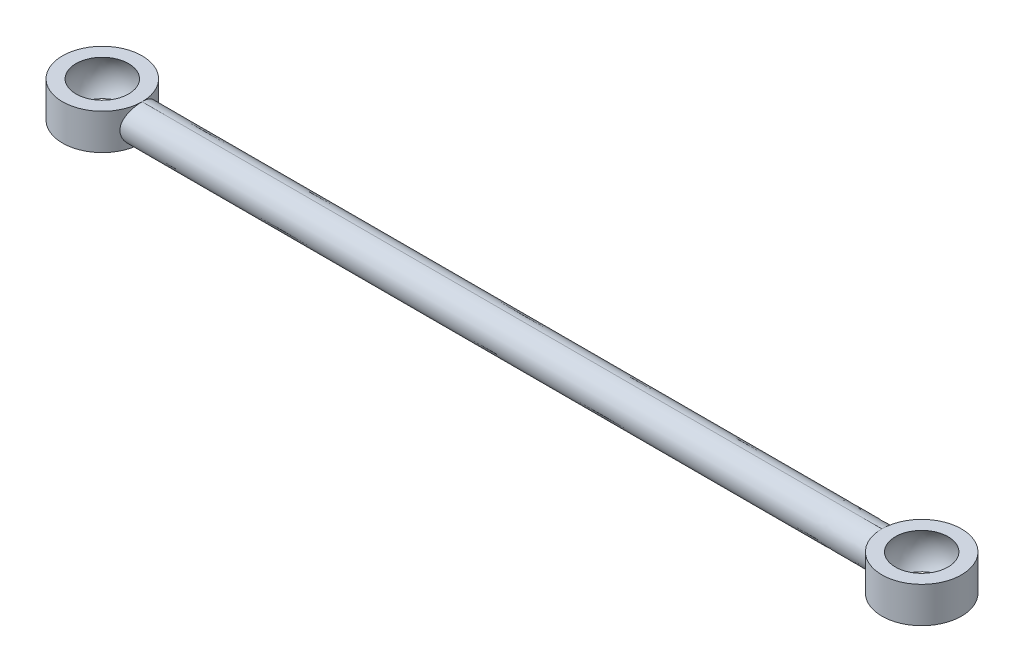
ISO-10303-21;
HEADER;
FILE_DESCRIPTION(('STEP AP214'),'2;1');
FILE_NAME('part.step','',(''),(''),'','','');
FILE_SCHEMA(('AUTOMOTIVE_DESIGN { 1 0 10303 214 1 1 1 1 }'));
ENDSEC;
DATA;
#1=APPLICATION_CONTEXT('core data for automotive mechanical design processes');
#2=APPLICATION_PROTOCOL_DEFINITION('international standard','automotive_design',2000,#1);
#3=PRODUCT_CONTEXT('',#1,'mechanical');
#4=PRODUCT('Part','Part','',(#3));
#5=PRODUCT_RELATED_PRODUCT_CATEGORY('part','',(#4));
#6=PRODUCT_DEFINITION_FORMATION('','',#4);
#7=PRODUCT_DEFINITION_CONTEXT('part definition',#1,'design');
#8=PRODUCT_DEFINITION('design','',#6,#7);
#9=PRODUCT_DEFINITION_SHAPE('','',#8);
#10=(LENGTH_UNIT() NAMED_UNIT(*) SI_UNIT(.MILLI.,.METRE.));
#11=(NAMED_UNIT(*) PLANE_ANGLE_UNIT() SI_UNIT($,.RADIAN.));
#12=(NAMED_UNIT(*) SI_UNIT($,.STERADIAN.) SOLID_ANGLE_UNIT());
#13=UNCERTAINTY_MEASURE_WITH_UNIT(LENGTH_MEASURE(1.E-05),#10,'distance_accuracy_value','');
#14=(GEOMETRIC_REPRESENTATION_CONTEXT(3) GLOBAL_UNCERTAINTY_ASSIGNED_CONTEXT((#13)) GLOBAL_UNIT_ASSIGNED_CONTEXT((#10,
#11,#12)) REPRESENTATION_CONTEXT('',''));
#15=CARTESIAN_POINT('',(0.,0.,0.));
#16=DIRECTION('',(0.,0.,1.));
#17=DIRECTION('',(1.,0.,0.));
#18=AXIS2_PLACEMENT_3D('',#15,#16,#17);
#19=CARTESIAN_POINT('',(-514.5,-22.5,0.));
#20=DIRECTION('',(0.,-1.,0.));
#21=DIRECTION('',(0.,0.,-1.));
#22=AXIS2_PLACEMENT_3D('',#19,#20,#21);
#23=CYLINDRICAL_SURFACE('',#22,50.);
#24=CARTESIAN_POINT('',(-464.500000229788,-22.4999995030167,-0.00464645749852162));
#25=CARTESIAN_POINT('',(-464.500294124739,-22.4993638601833,-2.97611393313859));
#26=CARTESIAN_POINT('',(-464.782487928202,-21.8890026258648,-5.97416280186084));
#27=CARTESIAN_POINT('',(-465.496373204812,-20.1957314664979,-10.0263118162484));
#28=CARTESIAN_POINT('',(-465.784300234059,-19.4945625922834,-11.3296306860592));
#29=CARTESIAN_POINT('',(-466.415109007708,-17.8598798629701,-13.7631098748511));
#30=CARTESIAN_POINT('',(-466.753547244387,-16.9382928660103,-14.8810600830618));
#31=CARTESIAN_POINT('',(-467.441675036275,-14.8885178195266,-16.9317379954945));
#32=CARTESIAN_POINT('',(-467.794316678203,-13.7486965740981,-17.8702274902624));
#33=CARTESIAN_POINT('',(-468.448297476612,-11.3298326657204,-19.493757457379));
#34=CARTESIAN_POINT('',(-468.752142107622,-10.0456498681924,-20.1873168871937));
#35=CARTESIAN_POINT('',(-469.273518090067,-7.31322401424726,-21.3297819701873));
#36=CARTESIAN_POINT('',(-469.484707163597,-5.89208013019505,-21.7653293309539));
#37=CARTESIAN_POINT('',(-469.772169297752,-2.9864457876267,-22.3501076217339));
#38=CARTESIAN_POINT('',(-469.84913182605,-1.47413997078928,-22.5011104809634));
#39=CARTESIAN_POINT('',(-469.848006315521,1.50784613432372,-22.4988768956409));
#40=CARTESIAN_POINT('',(-469.772626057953,2.9814182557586,-22.3510326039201));
#41=CARTESIAN_POINT('',(-469.484500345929,5.89458091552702,-21.7649127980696));
#42=CARTESIAN_POINT('',(-469.270128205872,7.33108852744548,-21.3223629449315));
#43=CARTESIAN_POINT('',(-468.497856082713,11.3781136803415,-19.6300945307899));
#44=CARTESIAN_POINT('',(-467.790410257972,13.8477677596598,-17.9685601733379));
#45=CARTESIAN_POINT('',(-466.759756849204,16.9207576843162,-14.9007689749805));
#46=CARTESIAN_POINT('',(-466.416538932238,17.8560249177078,-13.7680086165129));
#47=CARTESIAN_POINT('',(-465.785959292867,19.4904119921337,-11.3366453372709));
#48=CARTESIAN_POINT('',(-465.501207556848,20.1841051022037,-10.0510171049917));
#49=CARTESIAN_POINT('',(-465.021385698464,21.3225165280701,-7.3328938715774));
#50=CARTESIAN_POINT('',(-464.827053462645,21.7651172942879,-5.89274519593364));
#51=CARTESIAN_POINT('',(-464.568207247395,22.3495524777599,-2.98959195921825));
#52=CARTESIAN_POINT('',(-464.500143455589,22.4996835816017,-1.51162503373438));
#53=CARTESIAN_POINT('',(-464.50000022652,22.4999995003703,-0.00476628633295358));
#54=B_SPLINE_CURVE_WITH_KNOTS('',3,(#24,#25,#26,#27,#28,#29,#30,#31,#32,#33,#34,#35,#36,#37,#38,
#39,#40,#41,#42,#43,#44,#45,#46,#47,#48,#49,#50,#51,#52,#53),.UNSPECIFIED.,.F.,.F.,(4,2,2,2,2,2,
2,2,2,2,2,2,2,2,4),(6.58263718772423E-05,0.125000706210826,0.187500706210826,0.250000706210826,
0.312500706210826,0.375000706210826,0.437500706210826,0.500000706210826,0.562500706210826,
0.625000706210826,0.750000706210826,0.812500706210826,0.875000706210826,0.937500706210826,
0.999934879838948),.UNSPECIFIED.);
#55=CARTESIAN_POINT('',(-464.500000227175,22.5,-0.00476628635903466));
#56=VERTEX_POINT('',#55);
#57=CARTESIAN_POINT('',(-464.500000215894,-22.5,-0.00464643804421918));
#58=VERTEX_POINT('',#57);
#59=EDGE_CURVE('E172',#56,#58,#54,.F.);
#60=ORIENTED_EDGE('',*,*,#59,.T.);
#61=CARTESIAN_POINT('',(-514.5,-22.5,0.));
#62=DIRECTION('',(0.,-1.,0.));
#63=DIRECTION('',(0.,0.,-1.));
#64=AXIS2_PLACEMENT_3D('',#61,#62,#63);
#65=CIRCLE('',#64,50.);
#66=CARTESIAN_POINT('',(-464.500000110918,-22.5,0.00333043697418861));
#67=VERTEX_POINT('',#66);
#68=EDGE_CURVE('E60',#67,#58,#65,.T.);
#69=ORIENTED_EDGE('',*,*,#68,.F.);
#70=CARTESIAN_POINT('',(-464.500000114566,22.4999997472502,0.00334427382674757));
#71=CARTESIAN_POINT('',(-464.500103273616,22.4997721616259,1.50901898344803));
#72=CARTESIAN_POINT('',(-464.56986999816,22.3458529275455,3.01657105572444));
#73=CARTESIAN_POINT('',(-464.829918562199,21.7585926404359,5.91639498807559));
#74=CARTESIAN_POINT('',(-465.019807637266,21.3262180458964,7.32322757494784));
#75=CARTESIAN_POINT('',(-465.501203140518,20.1841579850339,10.0517165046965));
#76=CARTESIAN_POINT('',(-465.790111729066,19.4797858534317,11.3532190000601));
#77=CARTESIAN_POINT('',(-466.415244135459,17.8592437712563,13.7624507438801));
#78=CARTESIAN_POINT('',(-466.755035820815,16.9346802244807,14.8865248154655));
#79=CARTESIAN_POINT('',(-467.449799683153,14.8634834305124,16.9549071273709));
#80=CARTESIAN_POINT('',(-467.796026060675,13.7427378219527,17.8746088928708));
#81=CARTESIAN_POINT('',(-468.448794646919,11.3276288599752,19.4948534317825));
#82=CARTESIAN_POINT('',(-468.757668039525,10.0191964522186,20.1996545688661));
#83=CARTESIAN_POINT('',(-469.532732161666,5.94967514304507,21.8973225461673));
#84=CARTESIAN_POINT('',(-469.849389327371,2.95655201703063,22.5016214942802));
#85=CARTESIAN_POINT('',(-469.848161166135,-1.49674742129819,22.4991841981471));
#86=CARTESIAN_POINT('',(-469.771084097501,-3.00449765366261,22.3479729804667));
#87=CARTESIAN_POINT('',(-469.48143565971,-5.91795772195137,21.7586001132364));
#88=CARTESIAN_POINT('',(-469.272022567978,-7.31979343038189,21.3263888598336));
#89=CARTESIAN_POINT('',(-468.756852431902,-10.0222244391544,20.197753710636));
#90=CARTESIAN_POINT('',(-468.44776635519,-11.3316917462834,19.49239898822));
#91=CARTESIAN_POINT('',(-467.795486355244,-13.744475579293,17.8731711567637));
#92=CARTESIAN_POINT('',(-467.450264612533,-14.8617196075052,16.9558200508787));
#93=CARTESIAN_POINT('',(-466.413308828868,-17.9541723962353,13.8701069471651));
#94=CARTESIAN_POINT('',(-465.741408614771,-19.6143524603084,11.4141396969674));
#95=CARTESIAN_POINT('',(-465.019262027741,-21.3274840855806,7.31964988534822));
#96=CARTESIAN_POINT('',(-464.828887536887,-21.7609508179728,5.90942515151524));
#97=CARTESIAN_POINT('',(-464.568425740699,-22.3490843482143,2.99589903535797));
#98=CARTESIAN_POINT('',(-464.500102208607,-22.4997745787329,1.48705550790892));
#99=CARTESIAN_POINT('',(-464.500000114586,-22.4999997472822,0.00333045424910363));
#100=B_SPLINE_CURVE_WITH_KNOTS('',3,(#70,#71,#72,#73,#74,#75,#76,#77,#78,#79,#80,#81,#82,#83,
#84,#85,#86,#87,#88,#89,#90,#91,#92,#93,#94,#95,#96,#97,#98,#99),.UNSPECIFIED.,.F.,.F.,(4,2,2,2,
2,2,2,2,2,2,2,2,2,2,4),(4.67293220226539E-05,0.0625004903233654,0.125000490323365,
0.187500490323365,0.250000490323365,0.312500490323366,0.375000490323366,0.500000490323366,
0.562500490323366,0.625000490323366,0.687500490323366,0.750000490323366,0.875000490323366,
0.937500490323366,0.999953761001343),.UNSPECIFIED.);
#101=CARTESIAN_POINT('',(-464.500000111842,22.5,0.00334427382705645));
#102=VERTEX_POINT('',#101);
#103=EDGE_CURVE('E96',#67,#102,#100,.F.);
#104=ORIENTED_EDGE('',*,*,#103,.T.);
#105=CARTESIAN_POINT('',(-514.5,22.5,0.));
#106=DIRECTION('',(0.,-1.,0.));
#107=DIRECTION('',(0.,0.,-1.));
#108=AXIS2_PLACEMENT_3D('',#105,#106,#107);
#109=CIRCLE('',#108,50.);
#110=EDGE_CURVE('E113',#102,#56,#109,.T.);
#111=ORIENTED_EDGE('',*,*,#110,.T.);
#112=EDGE_LOOP('',(#60,#69,#104,#111));
#113=FACE_BOUND('',#112,.T.);
#114=ADVANCED_FACE('F37',(#113),#23,.T.);
#115=CARTESIAN_POINT('',(-514.5,-1.19892921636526E-13,0.));
#116=DIRECTION('',(0.,-1.,0.));
#117=DIRECTION('',(-1.,0.,0.));
#118=AXIS2_PLACEMENT_3D('',#115,#116,#117);
#119=SPHERICAL_SURFACE('',#118,40.0000000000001);
#120=CARTESIAN_POINT('',(-514.5,22.5,0.));
#121=DIRECTION('',(0.,-1.,0.));
#122=DIRECTION('',(0.,0.,-1.));
#123=AXIS2_PLACEMENT_3D('',#120,#121,#122);
#124=CIRCLE('',#123,33.0718913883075);
#125=CARTESIAN_POINT('',(-547.571891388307,22.5,0.));
#126=VERTEX_POINT('',#125);
#127=EDGE_CURVE('E111',#126,#126,#124,.T.);
#128=CARTESIAN_POINT('',(-514.5,-22.5,0.));
#129=DIRECTION('',(0.,-1.,0.));
#130=DIRECTION('',(0.,0.,-1.));
#131=AXIS2_PLACEMENT_3D('',#128,#129,#130);
#132=CIRCLE('',#131,33.0718913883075);
#133=CARTESIAN_POINT('',(-547.571891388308,-22.5,0.));
#134=VERTEX_POINT('',#133);
#135=EDGE_CURVE('E11',#134,#134,#132,.T.);
#136=CARTESIAN_POINT('',(-547.571891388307,22.5,0.));
#137=CARTESIAN_POINT('',(-547.851929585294,22.0883908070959,0.));
#138=CARTESIAN_POINT('',(-548.124275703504,21.671548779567,0.));
#139=CARTESIAN_POINT('',(-548.65322145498,20.827990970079,0.));
#140=CARTESIAN_POINT('',(-548.909821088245,20.4012751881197,0.));
#141=CARTESIAN_POINT('',(-549.406911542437,19.5385617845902,0.));
#142=CARTESIAN_POINT('',(-549.647402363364,19.1025641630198,0.));
#143=CARTESIAN_POINT('',(-550.11194120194,18.2218956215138,0.));
#144=CARTESIAN_POINT('',(-550.33598921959,17.7772247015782,0.));
#145=CARTESIAN_POINT('',(-550.767329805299,16.8798292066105,0.));
#146=CARTESIAN_POINT('',(-550.974622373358,16.4271046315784,0.));
#147=CARTESIAN_POINT('',(-551.372163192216,15.5142329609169,0.));
#148=CARTESIAN_POINT('',(-551.562411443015,15.0540858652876,0.));
#149=CARTESIAN_POINT('',(-551.925598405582,14.1270105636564,0.));
#150=CARTESIAN_POINT('',(-552.098537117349,13.6600823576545,0.));
#151=CARTESIAN_POINT('',(-552.426863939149,12.7200957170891,0.));
#152=CARTESIAN_POINT('',(-552.582252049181,12.2470372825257,0.));
#153=CARTESIAN_POINT('',(-552.875261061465,11.2954496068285,0.));
#154=CARTESIAN_POINT('',(-553.012881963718,10.8169203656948,0.));
#155=CARTESIAN_POINT('',(-553.270164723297,9.855058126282,0.));
#156=CARTESIAN_POINT('',(-553.389826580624,9.37172512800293,0.));
#157=CARTESIAN_POINT('',(-553.611024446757,8.40092911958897,0.));
#158=CARTESIAN_POINT('',(-553.712560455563,7.91346610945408,0.));
#159=CARTESIAN_POINT('',(-553.897365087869,6.93508957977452,0.));
#160=CARTESIAN_POINT('',(-553.980633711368,6.44417606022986,0.));
#161=CARTESIAN_POINT('',(-554.128787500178,5.45958282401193,0.));
#162=CARTESIAN_POINT('',(-554.193672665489,4.96590310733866,0.));
#163=CARTESIAN_POINT('',(-554.304969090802,3.97646564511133,0.));
#164=CARTESIAN_POINT('',(-554.351380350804,3.48070789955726,0.));
#165=CARTESIAN_POINT('',(-554.425664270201,2.48780544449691,0.));
#166=CARTESIAN_POINT('',(-554.453536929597,1.99066073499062,0.));
#167=CARTESIAN_POINT('',(-554.490704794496,0.995677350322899,0.));
#168=CARTESIAN_POINT('',(-554.5,0.497838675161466,0.));
#169=CARTESIAN_POINT('',(-554.5,-0.497838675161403,0.));
#170=CARTESIAN_POINT('',(-554.490704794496,-0.995677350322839,0.));
#171=CARTESIAN_POINT('',(-554.453536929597,-1.99066073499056,0.));
#172=CARTESIAN_POINT('',(-554.425664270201,-2.48780544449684,0.));
#173=CARTESIAN_POINT('',(-554.351380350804,-3.4807078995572,0.));
#174=CARTESIAN_POINT('',(-554.304969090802,-3.97646564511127,0.));
#175=CARTESIAN_POINT('',(-554.19367266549,-4.9659031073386,0.));
#176=CARTESIAN_POINT('',(-554.128787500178,-5.45958282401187,0.));
#177=CARTESIAN_POINT('',(-553.980633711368,-6.44417606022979,0.));
#178=CARTESIAN_POINT('',(-553.897365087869,-6.93508957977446,0.));
#179=CARTESIAN_POINT('',(-553.712560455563,-7.91346610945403,0.));
#180=CARTESIAN_POINT('',(-553.611024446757,-8.40092911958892,0.));
#181=CARTESIAN_POINT('',(-553.389826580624,-9.37172512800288,0.));
#182=CARTESIAN_POINT('',(-553.270164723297,-9.85505812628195,0.));
#183=CARTESIAN_POINT('',(-553.012881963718,-10.8169203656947,0.));
#184=CARTESIAN_POINT('',(-552.875261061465,-11.2954496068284,0.));
#185=CARTESIAN_POINT('',(-552.582252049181,-12.2470372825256,0.));
#186=CARTESIAN_POINT('',(-552.426863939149,-12.7200957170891,0.));
#187=CARTESIAN_POINT('',(-552.098537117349,-13.6600823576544,0.));
#188=CARTESIAN_POINT('',(-551.925598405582,-14.1270105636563,0.));
#189=CARTESIAN_POINT('',(-551.562411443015,-15.0540858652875,0.));
#190=CARTESIAN_POINT('',(-551.372163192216,-15.5142329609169,0.));
#191=CARTESIAN_POINT('',(-550.974622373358,-16.4271046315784,0.));
#192=CARTESIAN_POINT('',(-550.767329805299,-16.8798292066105,0.));
#193=CARTESIAN_POINT('',(-550.33598921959,-17.7772247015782,0.));
#194=CARTESIAN_POINT('',(-550.11194120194,-18.2218956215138,0.));
#195=CARTESIAN_POINT('',(-549.647402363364,-19.1025641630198,0.));
#196=CARTESIAN_POINT('',(-549.406911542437,-19.5385617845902,0.));
#197=CARTESIAN_POINT('',(-548.909821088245,-20.4012751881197,0.));
#198=CARTESIAN_POINT('',(-548.65322145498,-20.8279909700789,0.));
#199=CARTESIAN_POINT('',(-548.124275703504,-21.671548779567,0.));
#200=CARTESIAN_POINT('',(-547.851929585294,-22.0883908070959,0.));
#201=CARTESIAN_POINT('',(-547.571891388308,-22.5,0.));
#202=B_SPLINE_CURVE_WITH_KNOTS('',3,(#136,#137,#138,#139,#140,#141,#142,#143,#144,#145,#146,
#147,#148,#149,#150,#151,#152,#153,#154,#155,#156,#157,#158,#159,#160,#161,#162,#163,#164,#165,
#166,#167,#168,#169,#170,#171,#172,#173,#174,#175,#176,#177,#178,#179,#180,#181,#182,#183,#184,
#185,#186,#187,#188,#189,#190,#191,#192,#193,#194,#195,#196,#197,#198,#199,#200,#201),
.UNSPECIFIED.,.F.,.F.,(4,2,2,2,2,2,2,2,2,2,2,2,2,2,2,2,2,2,2,2,2,2,2,2,2,2,2,2,2,2,2,2,4),(0.,
1.49342928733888,2.98685857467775,4.48028786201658,5.97371714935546,7.46714643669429,
8.96057572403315,10.454005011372,11.9474342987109,13.4408635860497,14.9342928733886,
16.4277221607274,17.9211514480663,19.4145807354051,20.908010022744,22.4014393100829,
23.8948685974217,25.3882978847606,26.8817271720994,28.3751564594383,29.8685857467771,
31.362015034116,32.8554443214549,34.3488736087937,35.8423028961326,37.3357321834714,
38.8291614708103,40.3225907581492,41.816020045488,43.3094493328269,44.8028786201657,
46.2963079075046,47.7897371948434),.UNSPECIFIED.);
#203=EDGE_CURVE('BSEAM39',#126,#134,#202,.T.);
#204=ORIENTED_EDGE('',*,*,#127,.F.);
#205=ORIENTED_EDGE('',*,*,#135,.T.);
#206=ORIENTED_EDGE('',*,*,#203,.T.);
#207=ORIENTED_EDGE('',*,*,#203,.F.);
#208=EDGE_LOOP('',(#204,#206,#205,#207));
#209=FACE_BOUND('',#208,.T.);
#210=ADVANCED_FACE('F39',(#209),#119,.F.);
#211=CARTESIAN_POINT('',(-564.5,-22.5,0.));
#212=DIRECTION('',(0.,1.,0.));
#213=DIRECTION('',(0.,0.,1.));
#214=AXIS2_PLACEMENT_3D('',#211,#212,#213);
#215=PLANE('',#214);
#216=ORIENTED_EDGE('',*,*,#135,.F.);
#217=EDGE_LOOP('',(#216));
#218=FACE_BOUND('',#217,.T.);
#219=CARTESIAN_POINT('',(-464.5,-22.5,0.));
#220=CARTESIAN_POINT('',(-464.5,-22.5,-0.00154881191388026));
#221=CARTESIAN_POINT('',(-464.5000000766,-22.4999998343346,-0.00309763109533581));
#222=CARTESIAN_POINT('',(-464.500000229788,-22.4999995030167,-0.00464645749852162));
#223=B_SPLINE_CURVE_WITH_KNOTS('',3,(#219,#220,#221,#222),.UNSPECIFIED.,.F.,.F.,(4,4),
(0.999934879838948,1.),.UNSPECIFIED.);
#224=CARTESIAN_POINT('',(-464.5,-22.5,0.));
#225=VERTEX_POINT('',#224);
#226=EDGE_CURVE('E52',#58,#225,#223,.F.);
#227=ORIENTED_EDGE('',*,*,#226,.T.);
#228=CARTESIAN_POINT('',(-514.5,-22.5,0.));
#229=DIRECTION('',(0.,-1.,0.));
#230=DIRECTION('',(0.,0.,-1.));
#231=AXIS2_PLACEMENT_3D('',#228,#229,#230);
#232=CIRCLE('',#231,50.);
#233=EDGE_CURVE('E94',#225,#67,#232,.T.);
#234=ORIENTED_EDGE('',*,*,#233,.T.);
#235=ORIENTED_EDGE('',*,*,#68,.T.);
#236=EDGE_LOOP('',(#227,#234,#235));
#237=FACE_BOUND('',#236,.T.);
#238=ADVANCED_FACE('F132',(#218,#237),#215,.F.);
#239=CARTESIAN_POINT('',(-547.571891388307,22.5,0.));
#240=DIRECTION('',(0.,-1.,0.));
#241=DIRECTION('',(0.,0.,-1.));
#242=AXIS2_PLACEMENT_3D('',#239,#240,#241);
#243=PLANE('',#242);
#244=CARTESIAN_POINT('',(-464.50000022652,22.4999995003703,-0.00476628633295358));
#245=CARTESIAN_POINT('',(-464.500000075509,22.4999998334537,-0.0031775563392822));
#246=CARTESIAN_POINT('',(-464.5,22.5,-0.00158879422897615));
#247=CARTESIAN_POINT('',(-464.5,22.5,0.));
#248=B_SPLINE_CURVE_WITH_KNOTS('',3,(#244,#245,#246,#247),.UNSPECIFIED.,.F.,.F.,(4,4),(0.,
6.58263718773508E-05),.UNSPECIFIED.);
#249=CARTESIAN_POINT('',(-464.5,22.5,0.));
#250=VERTEX_POINT('',#249);
#251=EDGE_CURVE('E177',#56,#250,#248,.T.);
#252=ORIENTED_EDGE('',*,*,#251,.F.);
#253=ORIENTED_EDGE('',*,*,#110,.F.);
#254=CARTESIAN_POINT('',(-464.5,22.5,0.));
#255=CARTESIAN_POINT('',(-464.5,22.5,0.0011147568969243));
#256=CARTESIAN_POINT('',(-464.50000003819,22.4999999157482,0.00222951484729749));
#257=CARTESIAN_POINT('',(-464.500000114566,22.4999997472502,0.00334427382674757));
#258=B_SPLINE_CURVE_WITH_KNOTS('',3,(#254,#255,#256,#257),.UNSPECIFIED.,.F.,.F.,(4,4),
(0.999953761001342,1.),.UNSPECIFIED.);
#259=EDGE_CURVE('E152',#250,#102,#258,.T.);
#260=ORIENTED_EDGE('',*,*,#259,.F.);
#261=EDGE_LOOP('',(#252,#253,#260));
#262=FACE_BOUND('',#261,.T.);
#263=ORIENTED_EDGE('',*,*,#127,.T.);
#264=EDGE_LOOP('',(#263));
#265=FACE_BOUND('',#264,.T.);
#266=ADVANCED_FACE('F127',(#262,#265),#243,.F.);
#267=CARTESIAN_POINT('',(-464.5,22.5,0.));
#268=CARTESIAN_POINT('',(-464.5,22.5,-1.5085084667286));
#269=CARTESIAN_POINT('',(-464.568070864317,22.3498604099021,-2.98806232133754));
#270=CARTESIAN_POINT('',(-464.827053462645,21.7651172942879,-5.89274519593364));
#271=CARTESIAN_POINT('',(-465.021385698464,21.3225165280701,-7.3328938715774));
#272=CARTESIAN_POINT('',(-465.501207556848,20.1841051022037,-10.0510171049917));
#273=CARTESIAN_POINT('',(-465.785959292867,19.4904119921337,-11.3366453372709));
#274=CARTESIAN_POINT('',(-466.416538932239,17.8560249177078,-13.7680086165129));
#275=CARTESIAN_POINT('',(-466.759756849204,16.9207576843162,-14.9007689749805));
#276=CARTESIAN_POINT('',(-467.790410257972,13.8477677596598,-17.9685601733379));
#277=CARTESIAN_POINT('',(-468.497856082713,11.3781136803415,-19.6300945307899));
#278=CARTESIAN_POINT('',(-469.270128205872,7.33108852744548,-21.3223629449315));
#279=CARTESIAN_POINT('',(-469.484500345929,5.89458091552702,-21.7649127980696));
#280=CARTESIAN_POINT('',(-469.772626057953,2.9814182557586,-22.3510326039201));
#281=CARTESIAN_POINT('',(-469.848006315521,1.50784613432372,-22.4988768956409));
#282=CARTESIAN_POINT('',(-469.849131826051,-1.47413997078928,-22.5011104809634));
#283=CARTESIAN_POINT('',(-469.772169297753,-2.9864457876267,-22.3501076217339));
#284=CARTESIAN_POINT('',(-469.484707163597,-5.89208013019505,-21.7653293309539));
#285=CARTESIAN_POINT('',(-469.273518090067,-7.31322401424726,-21.3297819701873));
#286=CARTESIAN_POINT('',(-468.752142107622,-10.0456498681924,-20.1873168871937));
#287=CARTESIAN_POINT('',(-468.448297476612,-11.3298326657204,-19.493757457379));
#288=CARTESIAN_POINT('',(-467.794316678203,-13.7486965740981,-17.8702274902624));
#289=CARTESIAN_POINT('',(-467.441675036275,-14.8885178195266,-16.9317379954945));
#290=CARTESIAN_POINT('',(-466.753547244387,-16.9382928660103,-14.8810600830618));
#291=CARTESIAN_POINT('',(-466.415109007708,-17.8598798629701,-13.7631098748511));
#292=CARTESIAN_POINT('',(-465.784300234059,-19.4945625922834,-11.3296306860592));
#293=CARTESIAN_POINT('',(-465.496373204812,-20.1957314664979,-10.0263118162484));
#294=CARTESIAN_POINT('',(-464.782239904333,-21.8895909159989,-5.97275497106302));
#295=CARTESIAN_POINT('',(-464.5,-22.5,-2.97298848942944));
#296=CARTESIAN_POINT('',(-464.5,-22.5,0.));
#297=B_SPLINE_CURVE_WITH_KNOTS('',3,(#267,#268,#269,#270,#271,#272,#273,#274,#275,#276,#277,
#278,#279,#280,#281,#282,#283,#284,#285,#286,#287,#288,#289,#290,#291,#292,#293,#294,#295,#296),
.UNSPECIFIED.,.F.,.F.,(4,2,2,2,2,2,2,2,2,2,2,2,2,2,4),(0.,0.0624999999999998,0.125,
0.187499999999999,0.249999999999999,0.374999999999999,0.437499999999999,0.499999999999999,
0.562499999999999,0.624999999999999,0.687499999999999,0.749999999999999,0.8125,0.875,1.),.UNSPECIFIED.);
#298=DIRECTION('',(1.,0.,0.));
#299=VECTOR('',#298,1.);
#300=SURFACE_OF_LINEAR_EXTRUSION('',#297,#299);
#301=CARTESIAN_POINT('',(464.5,-22.5,0.));
#302=CARTESIAN_POINT('',(464.499979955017,-22.4999904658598,-0.399650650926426));
#303=CARTESIAN_POINT('',(464.504790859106,-22.4889694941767,-0.799269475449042));
#304=CARTESIAN_POINT('',(464.523923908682,-22.4454538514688,-1.5970045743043));
#305=CARTESIAN_POINT('',(464.538243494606,-22.4129649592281,-1.99512122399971));
#306=CARTESIAN_POINT('',(464.576242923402,-22.3270631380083,-2.78861961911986));
#307=CARTESIAN_POINT('',(464.599922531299,-22.2736507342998,-3.18400143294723));
#308=CARTESIAN_POINT('',(464.656251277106,-22.1466124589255,-3.96925931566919));
#309=CARTESIAN_POINT('',(464.688864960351,-22.073066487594,-4.35915087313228));
#310=CARTESIAN_POINT('',(464.762737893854,-21.9060522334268,-5.13382683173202));
#311=CARTESIAN_POINT('',(464.803997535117,-21.8125830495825,-5.51861100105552));
#312=CARTESIAN_POINT('',(464.894701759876,-21.6060268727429,-6.28188383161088));
#313=CARTESIAN_POINT('',(464.944145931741,-21.4929408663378,-6.66037280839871));
#314=CARTESIAN_POINT('',(465.037319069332,-21.2781261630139,-7.31598941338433));
#315=CARTESIAN_POINT('',(465.079376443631,-21.1806501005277,-7.59475492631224));
#316=CARTESIAN_POINT('',(465.14547395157,-21.0263068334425,-8.0093916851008));
#317=CARTESIAN_POINT('',(465.168009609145,-20.9735012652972,-8.14702573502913));
#318=CARTESIAN_POINT('',(465.214047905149,-20.8651687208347,-8.42105864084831));
#319=CARTESIAN_POINT('',(465.237550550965,-20.8096417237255,-8.55745748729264));
#320=CARTESIAN_POINT('',(465.285487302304,-20.6959248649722,-8.82897188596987));
#321=CARTESIAN_POINT('',(465.309921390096,-20.6377350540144,-8.96408746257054));
#322=CARTESIAN_POINT('',(465.35968796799,-20.518779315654,-9.23300780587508));
#323=CARTESIAN_POINT('',(465.385020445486,-20.458013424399,-9.36681259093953));
#324=CARTESIAN_POINT('',(465.46231122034,-20.2718988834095,-9.76619736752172));
#325=CARTESIAN_POINT('',(465.51556495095,-20.1427284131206,-10.0297595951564));
#326=CARTESIAN_POINT('',(465.625253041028,-19.8744303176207,-10.5513117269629));
#327=CARTESIAN_POINT('',(465.681689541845,-19.7352959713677,-10.8092977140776));
#328=CARTESIAN_POINT('',(465.797391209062,-19.4474031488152,-11.3191976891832));
#329=CARTESIAN_POINT('',(465.856656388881,-19.2986446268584,-11.5711116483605));
#330=CARTESIAN_POINT('',(465.977667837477,-18.9916755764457,-12.0685044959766));
#331=CARTESIAN_POINT('',(466.039414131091,-18.8334649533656,-12.3139833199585));
#332=CARTESIAN_POINT('',(466.165045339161,-18.5078884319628,-12.7982315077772));
#333=CARTESIAN_POINT('',(466.228930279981,-18.3405224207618,-13.037000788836));
#334=CARTESIAN_POINT('',(466.361682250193,-17.9884310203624,-13.5191689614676));
#335=CARTESIAN_POINT('',(466.43063959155,-17.8032565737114,-13.762215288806));
#336=CARTESIAN_POINT('',(466.570079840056,-17.4233327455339,-14.2402512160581));
#337=CARTESIAN_POINT('',(466.640562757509,-17.2285832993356,-14.4752407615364));
#338=CARTESIAN_POINT('',(466.782627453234,-16.8298087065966,-14.9368899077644));
#339=CARTESIAN_POINT('',(466.854209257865,-16.6257833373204,-15.1635493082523));
#340=CARTESIAN_POINT('',(466.962079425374,-16.3130672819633,-15.4970890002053));
#341=CARTESIAN_POINT('',(466.99811988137,-16.2077131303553,-15.6071964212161));
#342=CARTESIAN_POINT('',(467.070319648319,-15.9948336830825,-15.8252522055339));
#343=CARTESIAN_POINT('',(467.106478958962,-15.8873083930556,-15.9332005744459));
#344=CARTESIAN_POINT('',(467.215060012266,-15.5613383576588,-16.2537807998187));
#345=CARTESIAN_POINT('',(467.287552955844,-15.3395916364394,-16.4630493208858));
#346=CARTESIAN_POINT('',(467.432314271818,-14.8877751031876,-16.8724657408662));
#347=CARTESIAN_POINT('',(467.504582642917,-14.6577052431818,-17.0726135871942));
#348=CARTESIAN_POINT('',(467.648463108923,-14.189562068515,-17.4635873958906));
#349=CARTESIAN_POINT('',(467.720075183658,-13.9514885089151,-17.6544130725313));
#350=CARTESIAN_POINT('',(467.862177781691,-13.4676219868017,-18.0264576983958));
#351=CARTESIAN_POINT('',(467.932668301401,-13.2218289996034,-18.2076766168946));
#352=CARTESIAN_POINT('',(468.076462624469,-12.7066658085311,-18.5713720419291));
#353=CARTESIAN_POINT('',(468.149656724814,-12.4367947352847,-18.7531831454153));
#354=CARTESIAN_POINT('',(468.293672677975,-11.8890117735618,-19.1052733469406));
#355=CARTESIAN_POINT('',(468.364494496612,-11.6110997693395,-19.2755522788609));
#356=CARTESIAN_POINT('',(468.503154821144,-11.0475256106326,-19.6041333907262));
#357=CARTESIAN_POINT('',(468.5709931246,-10.7618629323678,-19.7624347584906));
#358=CARTESIAN_POINT('',(468.703102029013,-10.1832247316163,-20.0666799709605));
#359=CARTESIAN_POINT('',(468.767372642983,-9.89024923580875,-20.2126238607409));
#360=CARTESIAN_POINT('',(468.891797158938,-9.29763733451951,-20.491832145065));
#361=CARTESIAN_POINT('',(468.951953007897,-8.9980041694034,-20.6251025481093));
#362=CARTESIAN_POINT('',(469.067673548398,-8.39246348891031,-20.8787725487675));
#363=CARTESIAN_POINT('',(469.123238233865,-8.08655596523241,-20.9991721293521));
#364=CARTESIAN_POINT('',(469.229214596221,-7.468987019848,-21.2266753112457));
#365=CARTESIAN_POINT('',(469.279626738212,-7.15732612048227,-21.3337801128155));
#366=CARTESIAN_POINT('',(469.374832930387,-6.52882093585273,-21.5344288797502));
#367=CARTESIAN_POINT('',(469.419627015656,-6.21197668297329,-21.6279729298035));
#368=CARTESIAN_POINT('',(469.500901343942,-5.59084236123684,-21.7965456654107));
#369=CARTESIAN_POINT('',(469.537698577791,-5.28679003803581,-21.8722981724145));
#370=CARTESIAN_POINT('',(469.605515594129,-4.67517687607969,-22.0111615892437));
#371=CARTESIAN_POINT('',(469.636535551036,-4.36761614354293,-22.0742728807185));
#372=CARTESIAN_POINT('',(469.692389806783,-3.74953866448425,-22.1874303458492));
#373=CARTESIAN_POINT('',(469.71722402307,-3.43902187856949,-22.2374763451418));
#374=CARTESIAN_POINT('',(469.760626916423,-2.81574021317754,-22.3246693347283));
#375=CARTESIAN_POINT('',(469.779195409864,-2.50297526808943,-22.36181594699));
#376=CARTESIAN_POINT('',(469.809905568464,-1.87604360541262,-22.4231272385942));
#377=CARTESIAN_POINT('',(469.822050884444,-1.56187778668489,-22.4472992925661));
#378=CARTESIAN_POINT('',(469.839772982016,-0.93261536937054,-22.4825380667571));
#379=CARTESIAN_POINT('',(469.845349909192,-0.617518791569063,-22.4936050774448));
#380=CARTESIAN_POINT('',(469.848609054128,-0.144734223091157,-22.5000729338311));
#381=CARTESIAN_POINT('',(469.848844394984,0.0128839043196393,-22.5005401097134));
#382=CARTESIAN_POINT('',(469.847654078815,0.32807745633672,-22.4981778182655));
#383=CARTESIAN_POINT('',(469.846228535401,0.485652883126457,-22.4953485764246));
#384=CARTESIAN_POINT('',(469.839460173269,0.958209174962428,-22.4819106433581));
#385=CARTESIAN_POINT('',(469.831625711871,1.2730332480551,-22.466351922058));
#386=CARTESIAN_POINT('',(469.810364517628,1.87267196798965,-22.4240267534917));
#387=CARTESIAN_POINT('',(469.797516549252,2.15759086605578,-22.3984190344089));
#388=CARTESIAN_POINT('',(469.766469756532,2.72594681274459,-22.336348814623));
#389=CARTESIAN_POINT('',(469.748271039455,3.0093838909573,-22.2998865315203));
#390=CARTESIAN_POINT('',(469.706682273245,3.57428607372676,-22.2162298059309));
#391=CARTESIAN_POINT('',(469.683292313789,3.85575121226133,-22.1690355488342));
#392=CARTESIAN_POINT('',(469.644506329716,4.27611567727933,-22.0903947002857));
#393=CARTESIAN_POINT('',(469.630960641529,4.41593330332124,-22.0628724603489));
#394=CARTESIAN_POINT('',(469.602628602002,4.69489891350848,-22.0051601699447));
#395=CARTESIAN_POINT('',(469.587842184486,4.83404686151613,-21.9749699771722));
#396=CARTESIAN_POINT('',(469.541679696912,5.25041256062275,-21.8804561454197));
#397=CARTESIAN_POINT('',(469.508500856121,5.52654715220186,-21.8121901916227));
#398=CARTESIAN_POINT('',(469.437671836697,6.07551316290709,-21.6654843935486));
#399=CARTESIAN_POINT('',(469.400021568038,6.34834451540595,-21.5870443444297));
#400=CARTESIAN_POINT('',(469.320546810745,6.89032781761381,-21.4202134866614));
#401=CARTESIAN_POINT('',(469.278722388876,7.15947982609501,-21.3318228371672));
#402=CARTESIAN_POINT('',(469.19117901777,7.69371864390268,-21.1452444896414));
#403=CARTESIAN_POINT('',(469.145460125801,7.95880551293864,-21.0470569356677));
#404=CARTESIAN_POINT('',(469.049315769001,8.49023320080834,-20.8386361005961));
#405=CARTESIAN_POINT('',(468.998809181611,8.75647443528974,-20.7281861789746));
#406=CARTESIAN_POINT('',(468.894314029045,9.28387309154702,-20.4972550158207));
#407=CARTESIAN_POINT('',(468.840325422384,9.54503045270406,-20.3767736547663));
#408=CARTESIAN_POINT('',(468.729289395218,10.0619993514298,-20.1261233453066));
#409=CARTESIAN_POINT('',(468.672241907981,10.3178107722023,-19.9959541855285));
#410=CARTESIAN_POINT('',(468.55549200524,10.8237922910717,-19.7262206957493));
#411=CARTESIAN_POINT('',(468.495789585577,11.0739623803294,-19.5866563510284));
#412=CARTESIAN_POINT('',(468.313251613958,11.8158115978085,-19.1541697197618));
#413=CARTESIAN_POINT('',(468.187005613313,12.2987364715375,-18.8474991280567));
#414=CARTESIAN_POINT('',(467.928555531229,13.238979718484,-18.1995117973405));
#415=CARTESIAN_POINT('',(467.796351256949,13.6962972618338,-17.8581939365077));
#416=CARTESIAN_POINT('',(467.515491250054,14.6278681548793,-17.1065115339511));
#417=CARTESIAN_POINT('',(467.366515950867,15.099215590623,-16.6926552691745));
#418=CARTESIAN_POINT('',(467.068655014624,16.0053124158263,-15.8264638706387));
#419=CARTESIAN_POINT('',(466.919769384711,16.4400591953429,-15.3741259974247));
#420=CARTESIAN_POINT('',(466.699614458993,17.0632590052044,-14.6691484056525));
#421=CARTESIAN_POINT('',(466.626739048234,17.2662233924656,-14.4296754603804));
#422=CARTESIAN_POINT('',(466.482503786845,17.6622274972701,-13.9421889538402));
#423=CARTESIAN_POINT('',(466.411143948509,17.8552671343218,-13.6941753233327));
#424=CARTESIAN_POINT('',(466.270396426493,18.2310579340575,-13.1899154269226));
#425=CARTESIAN_POINT('',(466.201008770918,18.4138089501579,-12.9336690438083));
#426=CARTESIAN_POINT('',(466.098742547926,18.679900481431,-12.5433792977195));
#427=CARTESIAN_POINT('',(466.064956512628,18.7672580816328,-12.4122966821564));
#428=CARTESIAN_POINT('',(465.998049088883,18.9393035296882,-12.1482227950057));
#429=CARTESIAN_POINT('',(465.964927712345,19.0239913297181,-12.0152314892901));
#430=CARTESIAN_POINT('',(465.842166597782,19.3361732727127,-11.5134112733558));
#431=CARTESIAN_POINT('',(465.754855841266,19.5547343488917,-11.1383867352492));
#432=CARTESIAN_POINT('',(465.58671007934,19.9702123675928,-10.3751032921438));
#433=CARTESIAN_POINT('',(465.505875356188,20.1671283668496,-9.98684381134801));
#434=CARTESIAN_POINT('',(465.390269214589,20.4457102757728,-9.39546298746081));
#435=CARTESIAN_POINT('',(465.352670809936,20.5357816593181,-9.19681399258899));
#436=CARTESIAN_POINT('',(465.279479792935,20.7102825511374,-8.79669052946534));
#437=CARTESIAN_POINT('',(465.243887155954,20.7947121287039,-8.59521609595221));
#438=CARTESIAN_POINT('',(465.14038097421,21.0389531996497,-7.98728696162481));
#439=CARTESIAN_POINT('',(465.075622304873,21.1899981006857,-7.57673137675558));
#440=CARTESIAN_POINT('',(464.955453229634,21.4685233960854,-6.74639642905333));
#441=CARTESIAN_POINT('',(464.900042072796,21.5960056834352,-6.32661781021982));
#442=CARTESIAN_POINT('',(464.824500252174,21.7689782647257,-5.69124194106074));
#443=CARTESIAN_POINT('',(464.800585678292,21.8235859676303,-5.4785366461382));
#444=CARTESIAN_POINT('',(464.755349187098,21.9266040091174,-5.05132135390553));
#445=CARTESIAN_POINT('',(464.734027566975,21.9750136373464,-4.83681115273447));
#446=CARTESIAN_POINT('',(464.696468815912,22.0600039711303,-4.43220341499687));
#447=CARTESIAN_POINT('',(464.679928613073,22.0973071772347,-4.24228528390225));
#448=CARTESIAN_POINT('',(464.648959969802,22.1670785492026,-3.86138973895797));
#449=CARTESIAN_POINT('',(464.634531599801,22.1995465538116,-3.67041229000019));
#450=CARTESIAN_POINT('',(464.594476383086,22.2895473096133,-3.0961152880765));
#451=CARTESIAN_POINT('',(464.572074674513,22.3396875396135,-2.71138002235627));
#452=CARTESIAN_POINT('',(464.536139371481,22.4199001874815,-1.93954450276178));
#453=CARTESIAN_POINT('',(464.522602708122,22.44997955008,-1.55244511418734));
#454=CARTESIAN_POINT('',(464.50904980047,22.4800185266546,-0.970849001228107));
#455=CARTESIAN_POINT('',(464.505657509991,22.4875181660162,-0.776790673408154));
#456=CARTESIAN_POINT('',(464.501132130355,22.4975100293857,-0.388491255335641));
#457=CARTESIAN_POINT('',(464.499999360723,22.5000015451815,-0.194250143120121));
#458=CARTESIAN_POINT('',(464.5,22.5,0.));
#459=B_SPLINE_CURVE_WITH_KNOTS('',3,(#301,#302,#303,#304,#305,#306,#307,#308,#309,#310,#311,
#312,#313,#314,#315,#316,#317,#318,#319,#320,#321,#322,#323,#324,#325,#326,#327,#328,#329,#330,
#331,#332,#333,#334,#335,#336,#337,#338,#339,#340,#341,#342,#343,#344,#345,#346,#347,#348,#349,
#350,#351,#352,#353,#354,#355,#356,#357,#358,#359,#360,#361,#362,#363,#364,#365,#366,#367,#368,
#369,#370,#371,#372,#373,#374,#375,#376,#377,#378,#379,#380,#381,#382,#383,#384,#385,#386,#387,
#388,#389,#390,#391,#392,#393,#394,#395,#396,#397,#398,#399,#400,#401,#402,#403,#404,#405,#406,
#407,#408,#409,#410,#411,#412,#413,#414,#415,#416,#417,#418,#419,#420,#421,#422,#423,#424,#425,
#426,#427,#428,#429,#430,#431,#432,#433,#434,#435,#436,#437,#438,#439,#440,#441,#442,#443,#444,
#445,#446,#447,#448,#449,#450,#451,#452,#453,#454,#455,#456,#457,#458),.UNSPECIFIED.,.F.,.F.,(4,
2,2,2,2,2,2,2,2,2,2,2,2,2,2,2,2,2,2,2,2,2,2,2,2,2,2,2,2,2,2,2,2,2,2,2,2,2,2,2,2,2,2,2,2,2,2,2,2,
2,2,2,2,2,2,2,2,2,2,2,2,2,2,2,2,2,2,2,2,2,2,2,2,2,2,2,2,2,4),(0.,1.1987253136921,
2.39712808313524,3.59550076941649,4.78918496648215,5.98292315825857,7.17660133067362,
8.07122451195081,8.51858251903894,8.96594394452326,9.41329685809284,9.86064349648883,
10.7552978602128,11.6505614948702,12.5458293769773,13.4411062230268,14.336394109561,
15.2758422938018,16.2152968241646,17.154773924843,17.6245337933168,18.0942924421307,
19.0342252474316,19.9741634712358,20.914130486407,21.8541005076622,22.8543833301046,
23.8546805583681,24.8550455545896,25.8554069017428,26.8552915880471,27.8551775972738,
28.8549732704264,29.8547626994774,30.80094618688,31.7471011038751,32.693268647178,
33.6394639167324,34.5851208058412,35.5307567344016,36.0035746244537,36.4763601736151,
37.4218917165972,38.2807080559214,39.1395071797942,39.9982914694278,40.427693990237,
40.8571194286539,41.7159856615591,42.5748691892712,43.4337389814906,44.2925961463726,
45.1702546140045,46.0479235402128,46.9256116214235,47.8033010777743,49.5589959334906,
51.3147476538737,53.246693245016,55.1787764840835,56.1453431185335,57.1119175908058,
58.0785058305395,58.5617951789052,59.0450931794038,60.3725480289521,61.7000607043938,
62.3639703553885,63.0278718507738,64.3536731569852,65.6793679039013,66.3419817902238,
67.0046715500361,67.58735228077,68.1700524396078,69.3352958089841,70.5001355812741,
71.0827658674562,71.6654785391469),.UNSPECIFIED.);
#460=CARTESIAN_POINT('',(464.5,-22.5,0.));
#461=VERTEX_POINT('',#460);
#462=CARTESIAN_POINT('',(464.5,22.5,0.));
#463=VERTEX_POINT('',#462);
#464=EDGE_CURVE('E99',#461,#463,#459,.T.);
#465=ORIENTED_EDGE('',*,*,#464,.F.);
#466=DIRECTION('',(1.,0.,0.));
#467=VECTOR('',#466,1.);
#468=CARTESIAN_POINT('',(-464.5,-22.5,0.));
#469=LINE('',#468,#467);
#470=EDGE_CURVE('E86',#225,#461,#469,.T.);
#471=ORIENTED_EDGE('',*,*,#470,.F.);
#472=ORIENTED_EDGE('',*,*,#226,.F.);
#473=ORIENTED_EDGE('',*,*,#59,.F.);
#474=ORIENTED_EDGE('',*,*,#251,.T.);
#475=DIRECTION('',(1.,0.,0.));
#476=VECTOR('',#475,1.);
#477=CARTESIAN_POINT('',(-464.5,22.5,0.));
#478=LINE('',#477,#476);
#479=EDGE_CURVE('E97',#250,#463,#478,.T.);
#480=ORIENTED_EDGE('',*,*,#479,.T.);
#481=EDGE_LOOP('',(#465,#471,#472,#473,#474,#480));
#482=FACE_BOUND('',#481,.T.);
#483=ADVANCED_FACE('F100',(#482),#300,.F.);
#484=CARTESIAN_POINT('',(-464.5,-22.5,0.));
#485=CARTESIAN_POINT('',(-464.5,-22.5,1.48479755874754));
#486=CARTESIAN_POINT('',(-464.56832833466,-22.3493042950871,2.99480945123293));
#487=CARTESIAN_POINT('',(-464.828887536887,-21.7609508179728,5.90942515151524));
#488=CARTESIAN_POINT('',(-465.019262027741,-21.3274840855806,7.31964988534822));
#489=CARTESIAN_POINT('',(-465.741408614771,-19.6143524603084,11.4141396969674));
#490=CARTESIAN_POINT('',(-466.413308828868,-17.9541723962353,13.8701069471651));
#491=CARTESIAN_POINT('',(-467.450264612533,-14.8617196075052,16.9558200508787));
#492=CARTESIAN_POINT('',(-467.795486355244,-13.744475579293,17.8731711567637));
#493=CARTESIAN_POINT('',(-468.44776635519,-11.3316917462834,19.49239898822));
#494=CARTESIAN_POINT('',(-468.756852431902,-10.0222244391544,20.197753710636));
#495=CARTESIAN_POINT('',(-469.272022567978,-7.31979343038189,21.3263888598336));
#496=CARTESIAN_POINT('',(-469.48143565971,-5.91795772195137,21.7586001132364));
#497=CARTESIAN_POINT('',(-469.771084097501,-3.00449765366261,22.3479729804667));
#498=CARTESIAN_POINT('',(-469.848161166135,-1.49674742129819,22.4991841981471));
#499=CARTESIAN_POINT('',(-469.849389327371,2.95655201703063,22.5016214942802));
#500=CARTESIAN_POINT('',(-469.532732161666,5.94967514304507,21.8973225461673));
#501=CARTESIAN_POINT('',(-468.757668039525,10.0191964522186,20.1996545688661));
#502=CARTESIAN_POINT('',(-468.448794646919,11.3276288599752,19.4948534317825));
#503=CARTESIAN_POINT('',(-467.796026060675,13.7427378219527,17.8746088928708));
#504=CARTESIAN_POINT('',(-467.449799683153,14.8634834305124,16.9549071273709));
#505=CARTESIAN_POINT('',(-466.755035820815,16.9346802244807,14.8865248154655));
#506=CARTESIAN_POINT('',(-466.415244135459,17.8592437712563,13.7624507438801));
#507=CARTESIAN_POINT('',(-465.790111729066,19.4797858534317,11.3532190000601));
#508=CARTESIAN_POINT('',(-465.501203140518,20.1841579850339,10.0517165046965));
#509=CARTESIAN_POINT('',(-465.019807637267,21.3262180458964,7.32322757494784));
#510=CARTESIAN_POINT('',(-464.829918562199,21.7585926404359,5.91639498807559));
#511=CARTESIAN_POINT('',(-464.569773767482,22.3460702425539,3.01549797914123));
#512=CARTESIAN_POINT('',(-464.5,22.5,1.50678665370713));
#513=CARTESIAN_POINT('',(-464.5,22.5,0.));
#514=B_SPLINE_CURVE_WITH_KNOTS('',3,(#484,#485,#486,#487,#488,#489,#490,#491,#492,#493,#494,
#495,#496,#497,#498,#499,#500,#501,#502,#503,#504,#505,#506,#507,#508,#509,#510,#511,#512,#513),
.UNSPECIFIED.,.F.,.F.,(4,2,2,2,2,2,2,2,2,2,2,2,2,2,4),(0.,0.0624999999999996,0.124999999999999,
0.249999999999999,0.312499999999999,0.374999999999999,0.437499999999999,0.499999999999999,
0.624999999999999,0.6875,0.75,0.8125,0.875,0.9375,1.),.UNSPECIFIED.);
#515=DIRECTION('',(1.,0.,0.));
#516=VECTOR('',#515,1.);
#517=SURFACE_OF_LINEAR_EXTRUSION('',#514,#516);
#518=CARTESIAN_POINT('',(464.5,22.5,0.));
#519=CARTESIAN_POINT('',(464.499980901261,22.4999630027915,0.399989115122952));
#520=CARTESIAN_POINT('',(464.50479923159,22.489151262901,0.799947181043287));
#521=CARTESIAN_POINT('',(464.523964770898,22.4463032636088,1.59838003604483));
#522=CARTESIAN_POINT('',(464.538309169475,22.4142732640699,1.99685522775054));
#523=CARTESIAN_POINT('',(464.576379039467,22.3293177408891,2.7910971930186));
#524=CARTESIAN_POINT('',(464.600103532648,22.2763943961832,3.1868642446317));
#525=CARTESIAN_POINT('',(464.642448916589,22.1815270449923,3.77667461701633));
#526=CARTESIAN_POINT('',(464.657653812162,22.1474068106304,3.9722553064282));
#527=CARTESIAN_POINT('',(464.690271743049,22.0739710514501,4.3622548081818));
#528=CARTESIAN_POINT('',(464.707684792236,22.034655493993,4.55667361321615));
#529=CARTESIAN_POINT('',(464.763167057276,21.9091409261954,5.13798887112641));
#530=CARTESIAN_POINT('',(464.804481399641,21.8153695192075,5.52297200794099));
#531=CARTESIAN_POINT('',(464.895286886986,21.6078420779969,6.28651492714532));
#532=CARTESIAN_POINT('',(464.944777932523,21.4940862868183,6.66507478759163));
#533=CARTESIAN_POINT('',(465.038011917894,21.2780446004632,7.3206707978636));
#534=CARTESIAN_POINT('',(465.080084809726,21.1800341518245,7.59936366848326));
#535=CARTESIAN_POINT('',(465.168258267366,20.9733716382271,8.15215228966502));
#536=CARTESIAN_POINT('',(465.214359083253,20.8647189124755,8.42624775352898));
#537=CARTESIAN_POINT('',(465.310306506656,20.6369856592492,8.96939862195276));
#538=CARTESIAN_POINT('',(465.360153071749,20.5179052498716,9.23845408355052));
#539=CARTESIAN_POINT('',(465.463293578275,20.2695410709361,9.77113224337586));
#540=CARTESIAN_POINT('',(465.516587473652,20.1402574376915,10.0347550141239));
#541=CARTESIAN_POINT('',(465.626367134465,19.8717027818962,10.5564729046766));
#542=CARTESIAN_POINT('',(465.68285551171,19.7324235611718,10.8145632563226));
#543=CARTESIAN_POINT('',(465.798656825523,19.4442404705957,11.3246454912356));
#544=CARTESIAN_POINT('',(465.857969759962,19.2953366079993,11.5766373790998));
#545=CARTESIAN_POINT('',(466.039630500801,18.8344470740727,12.3229303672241));
#546=CARTESIAN_POINT('',(466.165719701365,18.508236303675,12.8076403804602));
#547=CARTESIAN_POINT('',(466.431940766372,17.8018415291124,13.7741130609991));
#548=CARTESIAN_POINT('',(466.572462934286,17.4197063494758,14.2543384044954));
#549=CARTESIAN_POINT('',(466.857918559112,16.6181221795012,15.1811506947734));
#550=CARTESIAN_POINT('',(467.002852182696,16.198671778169,15.6277363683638));
#551=CARTESIAN_POINT('',(467.293733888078,15.3249409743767,16.4855535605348));
#552=CARTESIAN_POINT('',(467.439682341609,14.8706471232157,16.8967712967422));
#553=CARTESIAN_POINT('',(467.656382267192,14.1647057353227,17.4848280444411));
#554=CARTESIAN_POINT('',(467.728255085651,13.9252730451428,17.6760769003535));
#555=CARTESIAN_POINT('',(467.870799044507,13.438542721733,18.0487507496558));
#556=CARTESIAN_POINT('',(467.941470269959,13.1912456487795,18.2301764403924));
#557=CARTESIAN_POINT('',(468.085268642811,12.6744830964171,18.5933601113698));
#558=CARTESIAN_POINT('',(468.158297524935,12.4045671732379,18.7745163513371));
#559=CARTESIAN_POINT('',(468.301885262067,11.8565879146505,19.1251172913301));
#560=CARTESIAN_POINT('',(468.372444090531,11.578524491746,19.2945618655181));
#561=CARTESIAN_POINT('',(468.510615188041,11.0148102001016,19.6216202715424));
#562=CARTESIAN_POINT('',(468.578227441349,10.7291592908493,19.7792340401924));
#563=CARTESIAN_POINT('',(468.709956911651,10.1506920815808,20.0823122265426));
#564=CARTESIAN_POINT('',(468.774074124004,9.85787577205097,20.2277766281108));
#565=CARTESIAN_POINT('',(468.898217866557,9.26558055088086,20.5061128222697));
#566=CARTESIAN_POINT('',(468.958245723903,8.96610384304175,20.6389887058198));
#567=CARTESIAN_POINT('',(469.073525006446,8.36071745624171,20.8914972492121));
#568=CARTESIAN_POINT('',(469.128776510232,8.05480788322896,21.0111301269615));
#569=CARTESIAN_POINT('',(469.234033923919,7.43717798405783,21.2369451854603));
#570=CARTESIAN_POINT('',(469.284039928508,7.12545776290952,21.3431276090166));
#571=CARTESIAN_POINT('',(469.378422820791,6.49690717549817,21.5419439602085));
#572=CARTESIAN_POINT('',(469.422799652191,6.18007675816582,21.6345777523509));
#573=CARTESIAN_POINT('',(469.542351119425,5.25802114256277,21.8824686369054));
#574=CARTESIAN_POINT('',(469.609809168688,4.64694728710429,22.02013671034));
#575=CARTESIAN_POINT('',(469.720862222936,3.41345351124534,22.2451036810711));
#576=CARTESIAN_POINT('',(469.764459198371,2.79103453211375,22.3324067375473));
#577=CARTESIAN_POINT('',(469.810465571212,1.85296327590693,22.4242397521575));
#578=CARTESIAN_POINT('',(469.822569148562,1.53958012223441,22.4483298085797));
#579=CARTESIAN_POINT('',(469.840136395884,0.911870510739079,22.4832606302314));
#580=CARTESIAN_POINT('',(469.845600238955,0.59754407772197,22.4941017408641));
#581=CARTESIAN_POINT('',(469.849692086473,-0.0313088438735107,22.5022224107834));
#582=CARTESIAN_POINT('',(469.848320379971,-0.345835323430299,22.4995025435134));
#583=CARTESIAN_POINT('',(469.838903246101,-0.974396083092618,22.4808039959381));
#584=CARTESIAN_POINT('',(469.830857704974,-1.2884303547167,22.4648250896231));
#585=CARTESIAN_POINT('',(469.809280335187,-1.88763986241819,22.4218664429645));
#586=CARTESIAN_POINT('',(469.796295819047,-2.17291430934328,22.3959829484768));
#587=CARTESIAN_POINT('',(469.765054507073,-2.74198606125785,22.3335145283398));
#588=CARTESIAN_POINT('',(469.746797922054,-3.02578342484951,22.2969300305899));
#589=CARTESIAN_POINT('',(469.705127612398,-3.59141284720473,22.2130953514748));
#590=CARTESIAN_POINT('',(469.681714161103,-3.8732450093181,22.1658457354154));
#591=CARTESIAN_POINT('',(469.642777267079,-4.29410301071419,22.0868834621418));
#592=CARTESIAN_POINT('',(469.62916183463,-4.43407708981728,22.0592140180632));
#593=CARTESIAN_POINT('',(469.600714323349,-4.71336366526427,22.001254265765));
#594=CARTESIAN_POINT('',(469.585882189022,-4.85267613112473,21.9709638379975));
#595=CARTESIAN_POINT('',(469.539600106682,-5.26956731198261,21.876183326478));
#596=CARTESIAN_POINT('',(469.50636694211,-5.54607331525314,21.8077889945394));
#597=CARTESIAN_POINT('',(469.435358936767,-6.09575377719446,21.6606738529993));
#598=CARTESIAN_POINT('',(469.397583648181,-6.3689279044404,21.5819520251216));
#599=CARTESIAN_POINT('',(469.317770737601,-6.91150313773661,21.4143590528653));
#600=CARTESIAN_POINT('',(469.275733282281,-7.1809043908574,21.3254883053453));
#601=CARTESIAN_POINT('',(469.187709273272,-7.71556974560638,21.1378107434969));
#602=CARTESIAN_POINT('',(469.141722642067,-7.98083376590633,21.0390037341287));
#603=CARTESIAN_POINT('',(469.045192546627,-8.51230689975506,20.8296436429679));
#604=CARTESIAN_POINT('',(468.994575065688,-8.77842417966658,20.7188914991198));
#605=CARTESIAN_POINT('',(468.889875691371,-9.30557372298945,20.4873784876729));
#606=CARTESIAN_POINT('',(468.835793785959,-9.56660596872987,20.3666175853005));
#607=CARTESIAN_POINT('',(468.724629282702,-10.0833715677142,20.1155237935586));
#608=CARTESIAN_POINT('',(468.667546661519,-10.3391048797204,19.9851908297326));
#609=CARTESIAN_POINT('',(468.550770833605,-10.8450008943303,19.7152217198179));
#610=CARTESIAN_POINT('',(468.491077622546,-11.0951635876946,19.5755855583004));
#611=CARTESIAN_POINT('',(468.369418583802,-11.5897075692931,19.2871451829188));
#612=CARTESIAN_POINT('',(468.307452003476,-11.834086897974,19.1383379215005));
#613=CARTESIAN_POINT('',(468.213058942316,-12.1959581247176,18.9083567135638));
#614=CARTESIAN_POINT('',(468.18135344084,-12.3158011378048,18.830566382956));
#615=CARTESIAN_POINT('',(468.117501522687,-12.5538778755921,18.6727362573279));
#616=CARTESIAN_POINT('',(468.085355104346,-12.6721115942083,18.5926964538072));
#617=CARTESIAN_POINT('',(467.988360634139,-13.024418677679,18.3493301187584));
#618=CARTESIAN_POINT('',(467.92295537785,-13.2561055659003,18.1827518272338));
#619=CARTESIAN_POINT('',(467.791000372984,-13.7127444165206,17.8410451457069));
#620=CARTESIAN_POINT('',(467.724450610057,-13.9376962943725,17.6659166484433));
#621=CARTESIAN_POINT('',(467.583855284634,-14.4028610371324,17.2892950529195));
#622=CARTESIAN_POINT('',(467.509728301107,-14.6423368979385,17.0869207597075));
#623=CARTESIAN_POINT('',(467.361049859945,-15.1125122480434,16.6723682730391));
#624=CARTESIAN_POINT('',(467.286498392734,-15.3432115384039,16.4601898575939));
#625=CARTESIAN_POINT('',(467.137497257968,-15.7956390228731,16.0264135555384));
#626=CARTESIAN_POINT('',(467.063047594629,-16.0173668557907,15.8048152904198));
#627=CARTESIAN_POINT('',(466.914715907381,-16.4514620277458,15.3524402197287));
#628=CARTESIAN_POINT('',(466.840833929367,-16.6638286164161,15.1216626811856));
#629=CARTESIAN_POINT('',(466.620717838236,-17.2865582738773,14.4158647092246));
#630=CARTESIAN_POINT('',(466.47604003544,-17.6824716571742,13.9274551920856));
#631=CARTESIAN_POINT('',(466.194654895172,-18.4329994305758,12.9177489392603));
#632=CARTESIAN_POINT('',(466.057947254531,-18.7876153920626,12.3964534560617));
#633=CARTESIAN_POINT('',(465.836982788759,-19.3489659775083,11.4915148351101));
#634=CARTESIAN_POINT('',(465.749683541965,-19.567287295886,11.1157522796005));
#635=CARTESIAN_POINT('',(465.58160411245,-19.9823793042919,10.3510273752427));
#636=CARTESIAN_POINT('',(465.500824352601,-20.1791485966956,9.9620641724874));
#637=CARTESIAN_POINT('',(465.346819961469,-20.5502645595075,9.1720695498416));
#638=CARTESIAN_POINT('',(465.273596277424,-20.7246084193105,8.77103662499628));
#639=CARTESIAN_POINT('',(465.1357781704,-21.0499721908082,7.95883347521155));
#640=CARTESIAN_POINT('',(465.071171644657,-21.201024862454,7.5476784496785));
#641=CARTESIAN_POINT('',(464.95132312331,-21.4790727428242,6.71603278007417));
#642=CARTESIAN_POINT('',(464.896079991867,-21.6060708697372,6.29554327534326));
#643=CARTESIAN_POINT('',(464.795729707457,-21.8353367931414,5.44683039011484));
#644=CARTESIAN_POINT('',(464.750618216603,-21.9376151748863,5.01861040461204));
#645=CARTESIAN_POINT('',(464.699337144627,-22.0534888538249,4.46204553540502));
#646=CARTESIAN_POINT('',(464.688243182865,-22.0785273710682,4.33645462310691));
#647=CARTESIAN_POINT('',(464.666973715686,-22.1264196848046,4.08478048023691));
#648=CARTESIAN_POINT('',(464.656798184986,-22.1492735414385,3.95869726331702));
#649=CARTESIAN_POINT('',(464.627673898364,-22.2145882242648,3.5798382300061));
#650=CARTESIAN_POINT('',(464.610121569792,-22.2538154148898,3.32638933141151));
#651=CARTESIAN_POINT('',(464.578831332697,-22.3236688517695,2.81811042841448));
#652=CARTESIAN_POINT('',(464.565092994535,-22.354296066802,2.56328058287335));
#653=CARTESIAN_POINT('',(464.541495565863,-22.4069366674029,2.05259971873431));
#654=CARTESIAN_POINT('',(464.531635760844,-22.4289516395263,1.79674889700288));
#655=CARTESIAN_POINT('',(464.515839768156,-22.464303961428,1.28429830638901));
#656=CARTESIAN_POINT('',(464.509904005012,-22.4776403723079,1.02769845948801));
#657=CARTESIAN_POINT('',(464.501981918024,-22.4954837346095,0.514067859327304));
#658=CARTESIAN_POINT('',(464.499996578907,-22.4999884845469,0.257037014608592));
#659=CARTESIAN_POINT('',(464.5,-22.5,0.));
#660=B_SPLINE_CURVE_WITH_KNOTS('',3,(#518,#519,#520,#521,#522,#523,#524,#525,#526,#527,#528,
#529,#530,#531,#532,#533,#534,#535,#536,#537,#538,#539,#540,#541,#542,#543,#544,#545,#546,#547,
#548,#549,#550,#551,#552,#553,#554,#555,#556,#557,#558,#559,#560,#561,#562,#563,#564,#565,#566,
#567,#568,#569,#570,#571,#572,#573,#574,#575,#576,#577,#578,#579,#580,#581,#582,#583,#584,#585,
#586,#587,#588,#589,#590,#591,#592,#593,#594,#595,#596,#597,#598,#599,#600,#601,#602,#603,#604,
#605,#606,#607,#608,#609,#610,#611,#612,#613,#614,#615,#616,#617,#618,#619,#620,#621,#622,#623,
#624,#625,#626,#627,#628,#629,#630,#631,#632,#633,#634,#635,#636,#637,#638,#639,#640,#641,#642,
#643,#644,#645,#646,#647,#648,#649,#650,#651,#652,#653,#654,#655,#656,#657,#658,#659),
.UNSPECIFIED.,.F.,.F.,(4,2,2,2,2,2,2,2,2,2,2,2,2,2,2,2,2,2,2,2,2,2,2,2,2,2,2,2,2,2,2,2,2,2,2,2,
2,2,2,2,2,2,2,2,2,2,2,2,2,2,2,2,2,2,2,2,2,2,2,2,2,2,2,2,2,2,2,2,2,2,4),(0.,1.19974296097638,
2.3991321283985,3.59839624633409,4.19567229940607,4.79295210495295,5.98742701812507,
7.1818874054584,8.07686139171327,8.97189098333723,9.86691043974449,10.7619179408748,
11.6576680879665,12.5534175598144,14.3446028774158,16.2313639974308,18.1181964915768,
20.0057609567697,20.9498092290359,21.8937903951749,22.893007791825,23.8922359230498,
24.8914693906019,25.8907041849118,26.889613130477,27.8885056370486,28.8873801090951,
29.886264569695,31.7736532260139,33.6608859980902,34.6042171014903,35.5475236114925,
36.4907902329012,37.434072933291,38.2940442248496,39.1539811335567,40.0138724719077,
40.4438374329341,40.8738220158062,41.7338723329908,42.5940075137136,43.4541090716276,
44.3142275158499,45.1919550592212,46.0696856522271,46.9474230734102,47.8251619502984,
48.7031940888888,49.1422268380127,49.5812612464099,50.4593024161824,51.3373546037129,
52.303611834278,53.2698909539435,54.2362089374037,55.2026042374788,57.1357338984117,
59.0687899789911,60.3978772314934,61.7270506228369,63.0563904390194,64.3838430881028,
65.7111345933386,67.0378567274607,67.4234696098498,67.8090718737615,68.5800805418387,
69.3510023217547,70.1217820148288,70.8926450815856,71.6637002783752),.UNSPECIFIED.);
#661=EDGE_CURVE('E91',#463,#461,#660,.T.);
#662=ORIENTED_EDGE('',*,*,#661,.F.);
#663=ORIENTED_EDGE('',*,*,#479,.F.);
#664=ORIENTED_EDGE('',*,*,#259,.T.);
#665=ORIENTED_EDGE('',*,*,#103,.F.);
#666=ORIENTED_EDGE('',*,*,#233,.F.);
#667=ORIENTED_EDGE('',*,*,#470,.T.);
#668=EDGE_LOOP('',(#662,#663,#664,#665,#666,#667));
#669=FACE_BOUND('',#668,.T.);
#670=ADVANCED_FACE('F88',(#669),#517,.F.);
#671=CARTESIAN_POINT('',(514.5,-22.5,0.));
#672=DIRECTION('',(0.,-1.,0.));
#673=DIRECTION('',(0.,0.,-1.));
#674=AXIS2_PLACEMENT_3D('',#671,#672,#673);
#675=CYLINDRICAL_SURFACE('',#674,50.);
#676=CARTESIAN_POINT('',(514.5,-22.5,0.));
#677=DIRECTION('',(0.,1.,0.));
#678=DIRECTION('',(0.,0.,-1.));
#679=AXIS2_PLACEMENT_3D('',#676,#677,#678);
#680=CIRCLE('',#679,50.);
#681=EDGE_CURVE('E109',#461,#461,#680,.T.);
#682=ORIENTED_EDGE('',*,*,#681,.T.);
#683=ORIENTED_EDGE('',*,*,#464,.T.);
#684=CARTESIAN_POINT('',(514.5,22.5,0.));
#685=DIRECTION('',(0.,1.,0.));
#686=DIRECTION('',(0.,0.,-1.));
#687=AXIS2_PLACEMENT_3D('',#684,#685,#686);
#688=CIRCLE('',#687,50.);
#689=EDGE_CURVE('E110',#463,#463,#688,.T.);
#690=ORIENTED_EDGE('',*,*,#689,.F.);
#691=ORIENTED_EDGE('',*,*,#661,.T.);
#692=EDGE_LOOP('',(#682,#683,#690,#691));
#693=FACE_BOUND('',#692,.T.);
#694=ADVANCED_FACE('F107',(#693),#675,.T.);
#695=CARTESIAN_POINT('',(514.5,-1.19892921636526E-13,0.));
#696=DIRECTION('',(0.,-1.,0.));
#697=DIRECTION('',(1.,0.,0.));
#698=AXIS2_PLACEMENT_3D('',#695,#696,#697);
#699=SPHERICAL_SURFACE('',#698,40.0000000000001);
#700=CARTESIAN_POINT('',(514.5,22.5,0.));
#701=DIRECTION('',(0.,1.,0.));
#702=DIRECTION('',(0.,0.,-1.));
#703=AXIS2_PLACEMENT_3D('',#700,#701,#702);
#704=CIRCLE('',#703,33.0718913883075);
#705=CARTESIAN_POINT('',(547.571891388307,22.5,0.));
#706=VERTEX_POINT('',#705);
#707=EDGE_CURVE('E221',#706,#706,#704,.T.);
#708=CARTESIAN_POINT('',(514.5,-22.5,0.));
#709=DIRECTION('',(0.,1.,0.));
#710=DIRECTION('',(0.,0.,-1.));
#711=AXIS2_PLACEMENT_3D('',#708,#709,#710);
#712=CIRCLE('',#711,33.0718913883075);
#713=CARTESIAN_POINT('',(547.571891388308,-22.5,0.));
#714=VERTEX_POINT('',#713);
#715=EDGE_CURVE('E203',#714,#714,#712,.T.);
#716=CARTESIAN_POINT('',(547.571891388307,22.5,0.));
#717=CARTESIAN_POINT('',(547.851929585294,22.0883908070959,0.));
#718=CARTESIAN_POINT('',(548.124275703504,21.671548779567,0.));
#719=CARTESIAN_POINT('',(548.65322145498,20.827990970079,0.));
#720=CARTESIAN_POINT('',(548.909821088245,20.4012751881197,0.));
#721=CARTESIAN_POINT('',(549.406911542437,19.5385617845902,0.));
#722=CARTESIAN_POINT('',(549.647402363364,19.1025641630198,0.));
#723=CARTESIAN_POINT('',(550.11194120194,18.2218956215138,0.));
#724=CARTESIAN_POINT('',(550.33598921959,17.7772247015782,0.));
#725=CARTESIAN_POINT('',(550.767329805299,16.8798292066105,0.));
#726=CARTESIAN_POINT('',(550.974622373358,16.4271046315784,0.));
#727=CARTESIAN_POINT('',(551.372163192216,15.5142329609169,0.));
#728=CARTESIAN_POINT('',(551.562411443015,15.0540858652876,0.));
#729=CARTESIAN_POINT('',(551.925598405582,14.1270105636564,0.));
#730=CARTESIAN_POINT('',(552.098537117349,13.6600823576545,0.));
#731=CARTESIAN_POINT('',(552.426863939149,12.7200957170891,0.));
#732=CARTESIAN_POINT('',(552.582252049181,12.2470372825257,0.));
#733=CARTESIAN_POINT('',(552.875261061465,11.2954496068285,0.));
#734=CARTESIAN_POINT('',(553.012881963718,10.8169203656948,0.));
#735=CARTESIAN_POINT('',(553.270164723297,9.85505812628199,0.));
#736=CARTESIAN_POINT('',(553.389826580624,9.37172512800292,0.));
#737=CARTESIAN_POINT('',(553.611024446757,8.40092911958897,0.));
#738=CARTESIAN_POINT('',(553.712560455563,7.91346610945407,0.));
#739=CARTESIAN_POINT('',(553.897365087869,6.93508957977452,0.));
#740=CARTESIAN_POINT('',(553.980633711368,6.44417606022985,0.));
#741=CARTESIAN_POINT('',(554.128787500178,5.45958282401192,0.));
#742=CARTESIAN_POINT('',(554.193672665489,4.96590310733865,0.));
#743=CARTESIAN_POINT('',(554.304969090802,3.97646564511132,0.));
#744=CARTESIAN_POINT('',(554.351380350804,3.48070789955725,0.));
#745=CARTESIAN_POINT('',(554.425664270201,2.4878054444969,0.));
#746=CARTESIAN_POINT('',(554.453536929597,1.99066073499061,0.));
#747=CARTESIAN_POINT('',(554.490704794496,0.99567735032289,0.));
#748=CARTESIAN_POINT('',(554.5,0.497838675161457,0.));
#749=CARTESIAN_POINT('',(554.5,-0.497838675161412,0.));
#750=CARTESIAN_POINT('',(554.490704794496,-0.995677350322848,0.));
#751=CARTESIAN_POINT('',(554.453536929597,-1.99066073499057,0.));
#752=CARTESIAN_POINT('',(554.425664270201,-2.48780544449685,0.));
#753=CARTESIAN_POINT('',(554.351380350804,-3.4807078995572,0.));
#754=CARTESIAN_POINT('',(554.304969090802,-3.97646564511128,0.));
#755=CARTESIAN_POINT('',(554.19367266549,-4.96590310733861,0.));
#756=CARTESIAN_POINT('',(554.128787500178,-5.45958282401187,0.));
#757=CARTESIAN_POINT('',(553.980633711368,-6.4441760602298,0.));
#758=CARTESIAN_POINT('',(553.897365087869,-6.93508957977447,0.));
#759=CARTESIAN_POINT('',(553.712560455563,-7.91346610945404,0.));
#760=CARTESIAN_POINT('',(553.611024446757,-8.40092911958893,0.));
#761=CARTESIAN_POINT('',(553.389826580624,-9.37172512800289,0.));
#762=CARTESIAN_POINT('',(553.270164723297,-9.85505812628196,0.));
#763=CARTESIAN_POINT('',(553.012881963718,-10.8169203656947,0.));
#764=CARTESIAN_POINT('',(552.875261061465,-11.2954496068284,0.));
#765=CARTESIAN_POINT('',(552.582252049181,-12.2470372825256,0.));
#766=CARTESIAN_POINT('',(552.426863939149,-12.7200957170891,0.));
#767=CARTESIAN_POINT('',(552.098537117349,-13.6600823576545,0.));
#768=CARTESIAN_POINT('',(551.925598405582,-14.1270105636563,0.));
#769=CARTESIAN_POINT('',(551.562411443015,-15.0540858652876,0.));
#770=CARTESIAN_POINT('',(551.372163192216,-15.5142329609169,0.));
#771=CARTESIAN_POINT('',(550.974622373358,-16.4271046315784,0.));
#772=CARTESIAN_POINT('',(550.767329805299,-16.8798292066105,0.));
#773=CARTESIAN_POINT('',(550.33598921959,-17.7772247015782,0.));
#774=CARTESIAN_POINT('',(550.11194120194,-18.2218956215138,0.));
#775=CARTESIAN_POINT('',(549.647402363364,-19.1025641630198,0.));
#776=CARTESIAN_POINT('',(549.406911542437,-19.5385617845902,0.));
#777=CARTESIAN_POINT('',(548.909821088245,-20.4012751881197,0.));
#778=CARTESIAN_POINT('',(548.65322145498,-20.8279909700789,0.));
#779=CARTESIAN_POINT('',(548.124275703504,-21.671548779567,0.));
#780=CARTESIAN_POINT('',(547.851929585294,-22.0883908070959,0.));
#781=CARTESIAN_POINT('',(547.571891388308,-22.5,0.));
#782=B_SPLINE_CURVE_WITH_KNOTS('',3,(#716,#717,#718,#719,#720,#721,#722,#723,#724,#725,#726,
#727,#728,#729,#730,#731,#732,#733,#734,#735,#736,#737,#738,#739,#740,#741,#742,#743,#744,#745,
#746,#747,#748,#749,#750,#751,#752,#753,#754,#755,#756,#757,#758,#759,#760,#761,#762,#763,#764,
#765,#766,#767,#768,#769,#770,#771,#772,#773,#774,#775,#776,#777,#778,#779,#780,#781),
.UNSPECIFIED.,.F.,.F.,(4,2,2,2,2,2,2,2,2,2,2,2,2,2,2,2,2,2,2,2,2,2,2,2,2,2,2,2,2,2,2,2,4),(0.,
1.49342928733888,2.98685857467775,4.48028786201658,5.97371714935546,7.46714643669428,
8.96057572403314,10.454005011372,11.9474342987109,13.4408635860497,14.9342928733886,
16.4277221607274,17.9211514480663,19.4145807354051,20.908010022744,22.4014393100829,
23.8948685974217,25.3882978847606,26.8817271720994,28.3751564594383,29.8685857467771,
31.362015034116,32.8554443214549,34.3488736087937,35.8423028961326,37.3357321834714,
38.8291614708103,40.3225907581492,41.816020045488,43.3094493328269,44.8028786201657,
46.2963079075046,47.7897371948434),.UNSPECIFIED.);
#783=EDGE_CURVE('BSEAM227',#706,#714,#782,.T.);
#784=ORIENTED_EDGE('',*,*,#707,.T.);
#785=ORIENTED_EDGE('',*,*,#715,.F.);
#786=ORIENTED_EDGE('',*,*,#783,.T.);
#787=ORIENTED_EDGE('',*,*,#783,.F.);
#788=EDGE_LOOP('',(#784,#786,#785,#787));
#789=FACE_BOUND('',#788,.T.);
#790=ADVANCED_FACE('F227',(#789),#699,.F.);
#791=CARTESIAN_POINT('',(564.5,-22.5,0.));
#792=DIRECTION('',(0.,1.,0.));
#793=DIRECTION('',(0.,0.,1.));
#794=AXIS2_PLACEMENT_3D('',#791,#792,#793);
#795=PLANE('',#794);
#796=ORIENTED_EDGE('',*,*,#715,.T.);
#797=EDGE_LOOP('',(#796));
#798=FACE_BOUND('',#797,.T.);
#799=ORIENTED_EDGE('',*,*,#681,.F.);
#800=EDGE_LOOP('',(#799));
#801=FACE_BOUND('',#800,.T.);
#802=ADVANCED_FACE('F232',(#798,#801),#795,.F.);
#803=CARTESIAN_POINT('',(547.571891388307,22.5,0.));
#804=DIRECTION('',(0.,-1.,0.));
#805=DIRECTION('',(0.,0.,-1.));
#806=AXIS2_PLACEMENT_3D('',#803,#804,#805);
#807=PLANE('',#806);
#808=ORIENTED_EDGE('',*,*,#689,.T.);
#809=EDGE_LOOP('',(#808));
#810=FACE_BOUND('',#809,.T.);
#811=ORIENTED_EDGE('',*,*,#707,.F.);
#812=EDGE_LOOP('',(#811));
#813=FACE_BOUND('',#812,.T.);
#814=ADVANCED_FACE('F230',(#810,#813),#807,.F.);
#815=CLOSED_SHELL('',(#114,#210,#238,#266,#483,#670,#694,#790,#802,#814));
#816=MANIFOLD_SOLID_BREP('B2',#815);
#817=ADVANCED_BREP_SHAPE_REPRESENTATION('',(#18,#816),#14);
#818=SHAPE_DEFINITION_REPRESENTATION(#9,#817);
ENDSEC;
END-ISO-10303-21;
